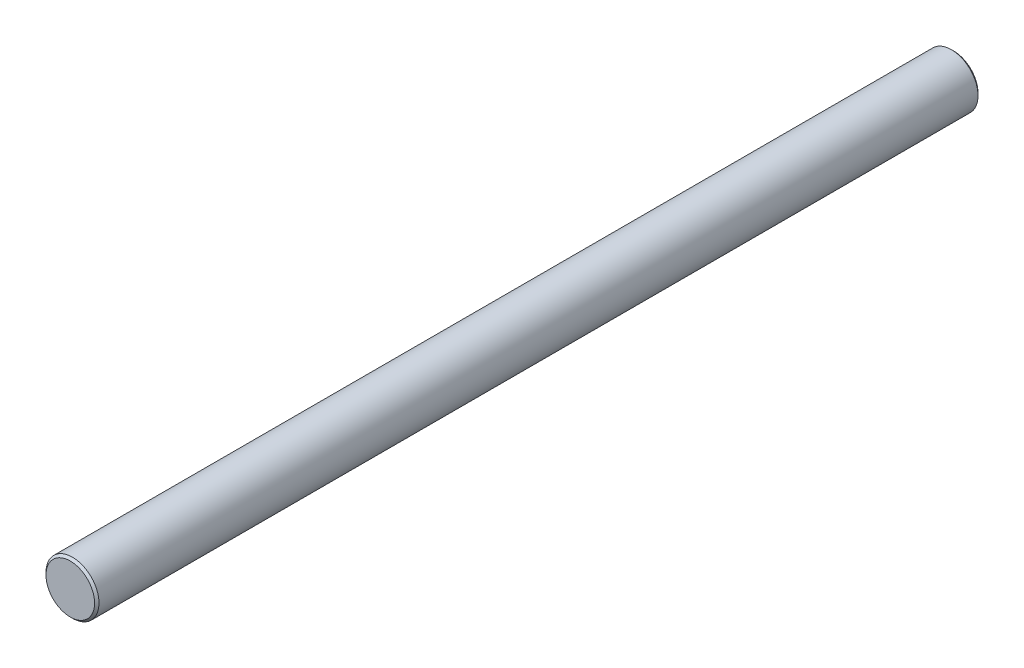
ISO-10303-21;
HEADER;
FILE_DESCRIPTION(('STEP AP214'),'2;1');
FILE_NAME('part.step','',(''),(''),'','','');
FILE_SCHEMA(('AUTOMOTIVE_DESIGN { 1 0 10303 214 1 1 1 1 }'));
ENDSEC;
DATA;
#1=APPLICATION_CONTEXT('core data for automotive mechanical design processes');
#2=APPLICATION_PROTOCOL_DEFINITION('international standard','automotive_design',2000,#1);
#3=PRODUCT_CONTEXT('',#1,'mechanical');
#4=PRODUCT('Part','Part','',(#3));
#5=PRODUCT_RELATED_PRODUCT_CATEGORY('part','',(#4));
#6=PRODUCT_DEFINITION_FORMATION('','',#4);
#7=PRODUCT_DEFINITION_CONTEXT('part definition',#1,'design');
#8=PRODUCT_DEFINITION('design','',#6,#7);
#9=PRODUCT_DEFINITION_SHAPE('','',#8);
#10=(LENGTH_UNIT() NAMED_UNIT(*) SI_UNIT(.MILLI.,.METRE.));
#11=(NAMED_UNIT(*) PLANE_ANGLE_UNIT() SI_UNIT($,.RADIAN.));
#12=(NAMED_UNIT(*) SI_UNIT($,.STERADIAN.) SOLID_ANGLE_UNIT());
#13=UNCERTAINTY_MEASURE_WITH_UNIT(LENGTH_MEASURE(1.E-05),#10,'distance_accuracy_value','');
#14=(GEOMETRIC_REPRESENTATION_CONTEXT(3) GLOBAL_UNCERTAINTY_ASSIGNED_CONTEXT((#13)) GLOBAL_UNIT_ASSIGNED_CONTEXT((#10,
#11,#12)) REPRESENTATION_CONTEXT('',''));
#15=CARTESIAN_POINT('',(0.,0.,0.));
#16=DIRECTION('',(0.,0.,1.));
#17=DIRECTION('',(1.,0.,0.));
#18=AXIS2_PLACEMENT_3D('',#15,#16,#17);
#19=CARTESIAN_POINT('',(0.,0.,100.));
#20=DIRECTION('',(0.,0.,-1.));
#21=DIRECTION('',(-1.,0.,0.));
#22=AXIS2_PLACEMENT_3D('',#19,#20,#21);
#23=CYLINDRICAL_SURFACE('',#22,3.);
#24=CARTESIAN_POINT('',(0.,0.,0.250000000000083));
#25=DIRECTION('',(0.,0.,1.));
#26=DIRECTION('',(1.,0.,0.));
#27=AXIS2_PLACEMENT_3D('',#24,#25,#26);
#28=CIRCLE('',#27,3.);
#29=CARTESIAN_POINT('',(-3.,0.,0.250000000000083));
#30=VERTEX_POINT('',#29);
#31=EDGE_CURVE('E40',#30,#30,#28,.T.);
#32=CARTESIAN_POINT('',(0.,0.,99.75));
#33=DIRECTION('',(0.,0.,1.));
#34=DIRECTION('',(1.,0.,0.));
#35=AXIS2_PLACEMENT_3D('',#32,#33,#34);
#36=CIRCLE('',#35,3.);
#37=CARTESIAN_POINT('',(-3.,0.,99.75));
#38=VERTEX_POINT('',#37);
#39=EDGE_CURVE('E44',#38,#38,#36,.F.);
#40=CARTESIAN_POINT('',(-3.,0.,0.250000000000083));
#41=CARTESIAN_POINT('',(-3.,0.,1.28645833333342));
#42=CARTESIAN_POINT('',(-3.,0.,2.32291666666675));
#43=CARTESIAN_POINT('',(-3.,0.,4.39583333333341));
#44=CARTESIAN_POINT('',(-3.,0.,5.43229166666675));
#45=CARTESIAN_POINT('',(-3.,0.,7.50520833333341));
#46=CARTESIAN_POINT('',(-3.,0.,8.54166666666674));
#47=CARTESIAN_POINT('',(-3.,0.,10.6145833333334));
#48=CARTESIAN_POINT('',(-3.,0.,11.6510416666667));
#49=CARTESIAN_POINT('',(-3.,0.,13.7239583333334));
#50=CARTESIAN_POINT('',(-3.,0.,14.7604166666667));
#51=CARTESIAN_POINT('',(-3.,0.,16.8333333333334));
#52=CARTESIAN_POINT('',(-3.,0.,17.8697916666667));
#53=CARTESIAN_POINT('',(-3.,0.,19.9427083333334));
#54=CARTESIAN_POINT('',(-3.,0.,20.9791666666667));
#55=CARTESIAN_POINT('',(-3.,0.,23.0520833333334));
#56=CARTESIAN_POINT('',(-3.,0.,24.0885416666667));
#57=CARTESIAN_POINT('',(-3.,0.,26.1614583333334));
#58=CARTESIAN_POINT('',(-3.,0.,27.1979166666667));
#59=CARTESIAN_POINT('',(-3.,0.,29.2708333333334));
#60=CARTESIAN_POINT('',(-3.,0.,30.3072916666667));
#61=CARTESIAN_POINT('',(-3.,0.,32.3802083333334));
#62=CARTESIAN_POINT('',(-3.,0.,33.4166666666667));
#63=CARTESIAN_POINT('',(-3.,0.,35.4895833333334));
#64=CARTESIAN_POINT('',(-3.,0.,36.5260416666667));
#65=CARTESIAN_POINT('',(-3.,0.,38.5989583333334));
#66=CARTESIAN_POINT('',(-3.,0.,39.6354166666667));
#67=CARTESIAN_POINT('',(-3.,0.,41.7083333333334));
#68=CARTESIAN_POINT('',(-3.,0.,42.7447916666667));
#69=CARTESIAN_POINT('',(-3.,0.,44.8177083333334));
#70=CARTESIAN_POINT('',(-3.,0.,45.8541666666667));
#71=CARTESIAN_POINT('',(-3.,0.,47.9270833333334));
#72=CARTESIAN_POINT('',(-3.,0.,48.9635416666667));
#73=CARTESIAN_POINT('',(-3.,0.,51.0364583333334));
#74=CARTESIAN_POINT('',(-3.,0.,52.0729166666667));
#75=CARTESIAN_POINT('',(-3.,0.,54.1458333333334));
#76=CARTESIAN_POINT('',(-3.,0.,55.1822916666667));
#77=CARTESIAN_POINT('',(-3.,0.,57.2552083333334));
#78=CARTESIAN_POINT('',(-3.,0.,58.2916666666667));
#79=CARTESIAN_POINT('',(-3.,0.,60.3645833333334));
#80=CARTESIAN_POINT('',(-3.,0.,61.4010416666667));
#81=CARTESIAN_POINT('',(-3.,0.,63.4739583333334));
#82=CARTESIAN_POINT('',(-3.,0.,64.5104166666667));
#83=CARTESIAN_POINT('',(-3.,0.,66.5833333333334));
#84=CARTESIAN_POINT('',(-3.,0.,67.6197916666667));
#85=CARTESIAN_POINT('',(-3.,0.,69.6927083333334));
#86=CARTESIAN_POINT('',(-3.,0.,70.7291666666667));
#87=CARTESIAN_POINT('',(-3.,0.,72.8020833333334));
#88=CARTESIAN_POINT('',(-3.,0.,73.8385416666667));
#89=CARTESIAN_POINT('',(-3.,0.,75.9114583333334));
#90=CARTESIAN_POINT('',(-3.,0.,76.9479166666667));
#91=CARTESIAN_POINT('',(-3.,0.,79.0208333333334));
#92=CARTESIAN_POINT('',(-3.,0.,80.0572916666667));
#93=CARTESIAN_POINT('',(-3.,0.,82.1302083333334));
#94=CARTESIAN_POINT('',(-3.,0.,83.1666666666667));
#95=CARTESIAN_POINT('',(-3.,0.,85.2395833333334));
#96=CARTESIAN_POINT('',(-3.,0.,86.2760416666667));
#97=CARTESIAN_POINT('',(-3.,0.,88.3489583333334));
#98=CARTESIAN_POINT('',(-3.,0.,89.3854166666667));
#99=CARTESIAN_POINT('',(-3.,0.,91.4583333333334));
#100=CARTESIAN_POINT('',(-3.,0.,92.4947916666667));
#101=CARTESIAN_POINT('',(-3.,0.,94.5677083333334));
#102=CARTESIAN_POINT('',(-3.,0.,95.6041666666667));
#103=CARTESIAN_POINT('',(-3.,0.,97.6770833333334));
#104=CARTESIAN_POINT('',(-3.,0.,98.7135416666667));
#105=CARTESIAN_POINT('',(-3.,0.,99.75));
#106=B_SPLINE_CURVE_WITH_KNOTS('',3,(#40,#41,#42,#43,#44,#45,#46,#47,#48,#49,#50,#51,#52,#53,
#54,#55,#56,#57,#58,#59,#60,#61,#62,#63,#64,#65,#66,#67,#68,#69,#70,#71,#72,#73,#74,#75,#76,#77,
#78,#79,#80,#81,#82,#83,#84,#85,#86,#87,#88,#89,#90,#91,#92,#93,#94,#95,#96,#97,#98,#99,#100,
#101,#102,#103,#104,#105),.UNSPECIFIED.,.F.,.F.,(4,2,2,2,2,2,2,2,2,2,2,2,2,2,2,2,2,2,2,2,2,2,2,
2,2,2,2,2,2,2,2,2,4),(0.,3.109375,6.21874999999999,9.32812499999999,12.4375,15.546875,18.65625,
21.765625,24.875,27.984375,31.09375,34.203125,37.3125,40.421875,43.53125,46.640625,49.75,
52.859375,55.96875,59.078125,62.1875,65.2968749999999,68.4062499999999,71.5156249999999,74.625,
77.734375,80.84375,83.9531249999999,87.0624999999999,90.1718749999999,93.2812499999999,
96.3906249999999,99.4999999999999),.UNSPECIFIED.);
#107=EDGE_CURVE('BSEAM29',#30,#38,#106,.T.);
#108=ORIENTED_EDGE('',*,*,#31,.T.);
#109=ORIENTED_EDGE('',*,*,#39,.T.);
#110=ORIENTED_EDGE('',*,*,#107,.T.);
#111=ORIENTED_EDGE('',*,*,#107,.F.);
#112=EDGE_LOOP('',(#108,#110,#109,#111));
#113=FACE_BOUND('',#112,.T.);
#114=ADVANCED_FACE('F29',(#113),#23,.T.);
#115=CARTESIAN_POINT('',(0.,0.,100.));
#116=DIRECTION('',(0.,0.,1.));
#117=DIRECTION('',(1.,0.,0.));
#118=AXIS2_PLACEMENT_3D('',#115,#116,#117);
#119=PLANE('',#118);
#120=CARTESIAN_POINT('',(0.,0.,100.));
#121=DIRECTION('',(0.,0.,1.));
#122=DIRECTION('',(1.,0.,0.));
#123=AXIS2_PLACEMENT_3D('',#120,#121,#122);
#124=CIRCLE('',#123,2.75000000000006);
#125=CARTESIAN_POINT('',(2.75000000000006,0.,100.));
#126=VERTEX_POINT('',#125);
#127=EDGE_CURVE('E10',#126,#126,#124,.T.);
#128=ORIENTED_EDGE('',*,*,#127,.T.);
#129=EDGE_LOOP('',(#128));
#130=FACE_BOUND('',#129,.T.);
#131=ADVANCED_FACE('F60',(#130),#119,.T.);
#132=CARTESIAN_POINT('',(0.,0.,0.));
#133=DIRECTION('',(0.,0.,1.));
#134=DIRECTION('',(1.,0.,0.));
#135=AXIS2_PLACEMENT_3D('',#132,#133,#134);
#136=PLANE('',#135);
#137=CARTESIAN_POINT('',(0.,0.,0.));
#138=DIRECTION('',(0.,0.,1.));
#139=DIRECTION('',(1.,0.,0.));
#140=AXIS2_PLACEMENT_3D('',#137,#138,#139);
#141=CIRCLE('',#140,2.74999999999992);
#142=CARTESIAN_POINT('',(2.74999999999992,0.,0.));
#143=VERTEX_POINT('',#142);
#144=EDGE_CURVE('E36',#143,#143,#141,.F.);
#145=ORIENTED_EDGE('',*,*,#144,.T.);
#146=EDGE_LOOP('',(#145));
#147=FACE_BOUND('',#146,.T.);
#148=ADVANCED_FACE('F57',(#147),#136,.F.);
#149=CARTESIAN_POINT('',(0.,0.,0.250000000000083));
#150=DIRECTION('',(0.,0.,1.));
#151=DIRECTION('',(1.,0.,0.));
#152=AXIS2_PLACEMENT_3D('',#149,#150,#151);
#153=CONICAL_SURFACE('',#152,3.,0.785398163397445);
#154=ORIENTED_EDGE('',*,*,#144,.F.);
#155=EDGE_LOOP('',(#154));
#156=FACE_BOUND('',#155,.T.);
#157=ORIENTED_EDGE('',*,*,#31,.F.);
#158=EDGE_LOOP('',(#157));
#159=FACE_BOUND('',#158,.T.);
#160=ADVANCED_FACE('F53',(#156,#159),#153,.T.);
#161=CARTESIAN_POINT('',(0.,0.,100.));
#162=DIRECTION('',(0.,0.,-1.));
#163=DIRECTION('',(-1.,0.,0.));
#164=AXIS2_PLACEMENT_3D('',#161,#162,#163);
#165=CONICAL_SURFACE('',#164,2.75000000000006,0.785398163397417);
#166=ORIENTED_EDGE('',*,*,#39,.F.);
#167=EDGE_LOOP('',(#166));
#168=FACE_BOUND('',#167,.T.);
#169=ORIENTED_EDGE('',*,*,#127,.F.);
#170=EDGE_LOOP('',(#169));
#171=FACE_BOUND('',#170,.T.);
#172=ADVANCED_FACE('F31',(#168,#171),#165,.T.);
#173=CLOSED_SHELL('',(#114,#131,#148,#160,#172));
#174=MANIFOLD_SOLID_BREP('B2',#173);
#175=ADVANCED_BREP_SHAPE_REPRESENTATION('',(#18,#174),#14);
#176=SHAPE_DEFINITION_REPRESENTATION(#9,#175);
ENDSEC;
END-ISO-10303-21;
